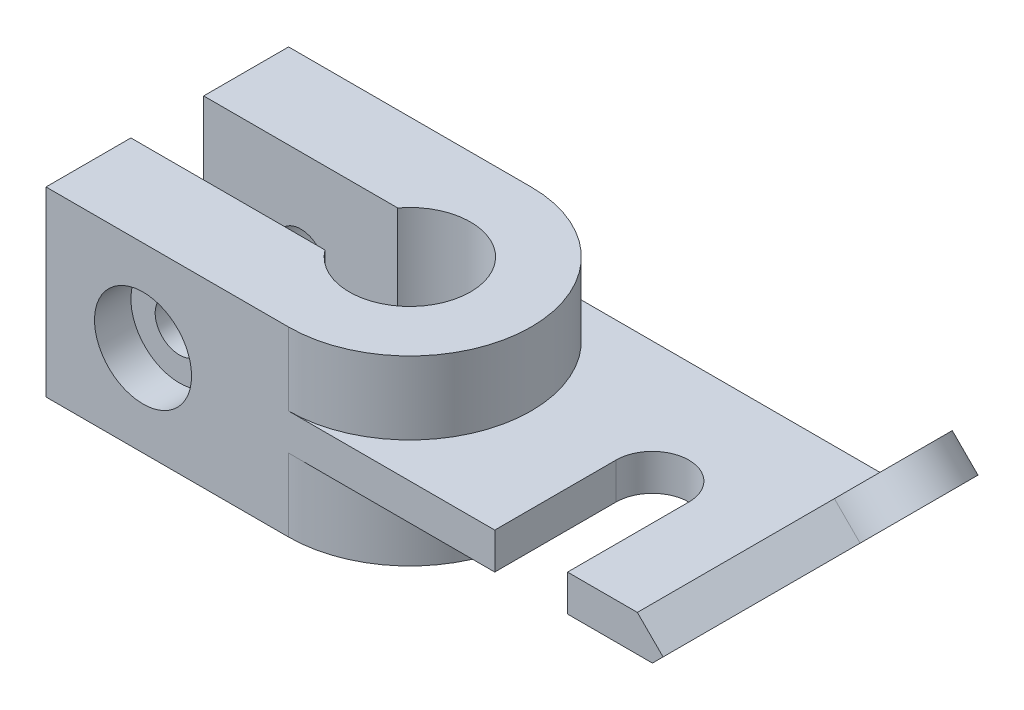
from build123d import *

# Parameters (mm, degrees)
SALIENTE_EXTRUIR1_DEPTH = 45
CROQUIS3_R              = 6
CORTAR_EXTRUIR1_DEPTH   = 97.046863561
CROQUIS3_4_R            = 12
CROQUIS3_4_R_2          = 6
CORTAR_EXTRUIR2_DEPTH   = 9
CORTAR_EXTRUIR3_START   = -9
CROQUIS4_R              = 12
CORTAR_EXTRUIR3_DEPTH   = 9
SALIENTE_EXTRUIR3_DEPTH = 45
CORTAR_EXTRUIR4_DEPTH   = 18
CORTAR_EXTRUIR5_DEPTH   = 18
SALIENTE_EXTRUIR4_DEPTH = 45
CROQUIS8_R              = 6
CORTAR_EXTRUIR7_DEPTH   = 118.153745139
CROQUIS9_R              = 12
CORTAR_EXTRUIR8_DEPTH   = 9
CORTAR_EXTRUIR9_START   = -9
CROQUIS10_R             = 12
CORTAR_EXTRUIR9_DEPTH   = 9
SALIENTE_EXTRUIR7_DEPTH = 60
CORTAR_EXTRUIR10_DEPTH  = 145.585715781
CORTAR_EXTRUIR11_DEPTH  = 145.585715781
CROQUIS21_R             = 7.5
CORTAR_EXTRUIR13_DEPTH  = 145.585715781


with BuildPart() as part:
    # Croquis2 → Saliente-Extruir1 (new body)
    with BuildSketch(Plane(origin=(0, 0, 0), x_dir=(1, 0, 0), z_dir=(0, 1, 0))):
        with BuildLine():
            Line((-12, 9), (-60, 9))
            Line((-60, 9), (-60, 30))
            Line((-60, 30), (0, 30))
            ThreePointArc((0, 30), (30, 0), (0, -30))
            Line((0, -30), (-60, -30))
            Line((-60, -30), (-60, -9))
            Line((-60, -9), (-12, -9))
            ThreePointArc((-12, -9), (15, 0), (-12, 9))
        make_face()
    extrude(amount=SALIENTE_EXTRUIR1_DEPTH)

    # Croquis3 → Cortar-Extruir1 (cut, through all)
    with BuildSketch(Plane.XY.offset(30)):
        with Locations((-36, 22.5)):
            Circle(CROQUIS3_R)
    extrude(amount=-CORTAR_EXTRUIR1_DEPTH, mode=Mode.SUBTRACT)

    # Croquis3_4 → Cortar-Extruir2 (cut)
    with BuildSketch(Plane.XY.offset(30)):
        with Locations((-36, 22.5)):
            Circle(CROQUIS3_4_R)
        with Locations((-36, 22.5)):
            Circle(CROQUIS3_4_R_2, mode=Mode.SUBTRACT)
    extrude(amount=-CORTAR_EXTRUIR2_DEPTH, mode=Mode.SUBTRACT)

    # Croquis4 → Cortar-Extruir3 (cut)
    with BuildSketch(Plane(origin=(0, 0, -30), x_dir=(-1, 0, 0), z_dir=(0, 0, -1)).offset(CORTAR_EXTRUIR3_START)):
        with Locations(Location((36, 22.5, 0), (0, 0, 180))):
            Circle(CROQUIS4_R)
    extrude(amount=CORTAR_EXTRUIR3_DEPTH, mode=Mode.SUBTRACT)

    # Croquis5 → Saliente-Extruir3 (add, through all)
    with BuildSketch(Plane(origin=(0, 45, 0), x_dir=(1, 0, 0), z_dir=(0, 1, 0))):
        with BuildLine():
            Line((51, 0), (51, -30))
            Line((51, -30), (0, -30))
            ThreePointArc((0, -30), (30, 0), (0, 30))
            Line((0, 30), (90, 30))
            Line((90, 30), (90, -30))
            Line((90, -30), (69, -30))
            Line((69, -30), (69, 0))
            ThreePointArc((69, 0), (60, 9), (51, 0))
        make_face()
    extrude(amount=-SALIENTE_EXTRUIR3_DEPTH)

    # Croquis6 → Cortar-Extruir4 (cut)
    with BuildSketch(Plane(origin=(0, 45, 0), x_dir=(1, 0, 0), z_dir=(0, 1, 0))):
        with BuildLine():
            Line((69, -30), (90, -30))
            Line((90, -30), (90, 30))
            Line((90, 30), (0, 30))
            Line((0, 30), (0, 15))
            ThreePointArc((0, 15), (15, 0), (0, -15))
            Line((0, -15), (0, -30))
            Line((0, -30), (51, -30))
            Line((51, -30), (51, 0))
            ThreePointArc((51, 0), (60, 9), (69, 0))
            Line((69, 0), (69, -30))
        make_face()
    extrude(amount=-CORTAR_EXTRUIR4_DEPTH, mode=Mode.SUBTRACT)

    # Croquis7 → Cortar-Extruir5 (cut)
    with BuildSketch(Plane.XZ):
        with BuildLine():
            Line((51, 30), (51, 0))
            ThreePointArc((51, 0), (60, -9), (69, 0))
            Line((69, 0), (69, 30))
            Line((69, 30), (90, 30))
            Line((90, 30), (90, -30))
            Line((90, -30), (0, -30))
            Line((0, -30), (0, -15))
            ThreePointArc((0, -15), (15, 0), (0, 15))
            Line((0, 15), (0, 30))
            Line((0, 30), (51, 30))
        make_face()
    extrude(amount=-CORTAR_EXTRUIR5_DEPTH, mode=Mode.SUBTRACT)

    # Croquis2_3 → Saliente-Extruir4 (add)
    with BuildSketch(Plane(origin=(0, 0, 0), x_dir=(1, 0, 0), z_dir=(0, 1, 0))):
        with BuildLine():
            Line((-12, 9), (-60, 9))
            Line((-60, 9), (-60, 30))
            Line((-60, 30), (0, 30))
            ThreePointArc((0, 30), (30, 0), (0, -30))
            Line((0, -30), (-60, -30))
            Line((-60, -30), (-60, -9))
            Line((-60, -9), (-12, -9))
            ThreePointArc((-12, -9), (15, 0), (-12, 9))
        make_face()
    extrude(amount=SALIENTE_EXTRUIR4_DEPTH)

    # Croquis8 → Cortar-Extruir7 (cut, through all)
    with BuildSketch(Plane.XY.offset(30)):
        with Locations((-36, 22.5)):
            Circle(CROQUIS8_R)
    extrude(amount=-CORTAR_EXTRUIR7_DEPTH, mode=Mode.SUBTRACT)

    # Croquis9 → Cortar-Extruir8 (cut)
    with BuildSketch(Plane.XY.offset(30)):
        with Locations((-36, 22.5)):
            Circle(CROQUIS9_R)
    extrude(amount=-CORTAR_EXTRUIR8_DEPTH, mode=Mode.SUBTRACT)

    # Croquis10 → Cortar-Extruir9 (cut)
    with BuildSketch(Plane(origin=(0, 0, -30), x_dir=(-1, 0, 0), z_dir=(0, 0, -1)).offset(CORTAR_EXTRUIR9_START)):
        with Locations(Location((36, 22.5, 0), (0, 0, 180))):
            Circle(CROQUIS10_R)
    extrude(amount=CORTAR_EXTRUIR9_DEPTH, mode=Mode.SUBTRACT)

    # Croquis16 → Saliente-Extruir7 (add, through all)
    with BuildSketch(Plane.XY.offset(30)):
        Polygon((90, 18), (132.779960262, 60.779960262), (126.415999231, 67.143921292), (83.636038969, 24.363961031), align=None)
    extrude(amount=-SALIENTE_EXTRUIR7_DEPTH)

    # Croquis18 → Cortar-Extruir10 (cut, through all)
    with BuildSketch(Plane(origin=(29.636038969, -29.636038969, 0), x_dir=(0, 0, 1), z_dir=(-0.7071067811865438, 0.7071067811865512, 0))):
        with BuildLine():
            Line((-30, 136.867532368), (-30, 80.09545443))
            Line((-30, 80.09545443), (-14.205841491, 126.68355433))
            ThreePointArc((-14.205841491, 126.68355433), (-8.739555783, 134.058519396), (0, 136.867532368))
            Line((0, 136.867532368), (-30, 136.867532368))
        make_face()
    extrude(amount=-CORTAR_EXTRUIR10_DEPTH, mode=Mode.SUBTRACT)

    # Croquis19 → Cortar-Extruir11 (cut, through all)
    with BuildSketch(Plane(origin=(29.636038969, -29.636038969, 0), x_dir=(0, 0, 1), z_dir=(-0.7071067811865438, 0.7071067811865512, 0))):
        with BuildLine():
            Line((30, 80.09545443), (14.205841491, 126.68355433))
            ThreePointArc((14.205841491, 126.68355433), (8.739555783, 134.058519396), (0, 136.867532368))
            Line((0, 136.867532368), (30, 136.867532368))
            Line((30, 136.867532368), (30, 80.09545443))
        make_face()
    extrude(amount=-CORTAR_EXTRUIR11_DEPTH, mode=Mode.SUBTRACT)

    # Croquis21 → Cortar-Extruir13 (cut, through all)
    with BuildSketch(Plane(origin=(29.636038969, -29.636038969, 0), x_dir=(0, 0, 1), z_dir=(-0.7071067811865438, 0.7071067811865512, 0))):
        with Locations(Location((0, 121.867532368, 0), (0, 0, 270))):
            Circle(CROQUIS21_R)
    extrude(amount=-CORTAR_EXTRUIR13_DEPTH, mode=Mode.SUBTRACT)


solid = part.part
